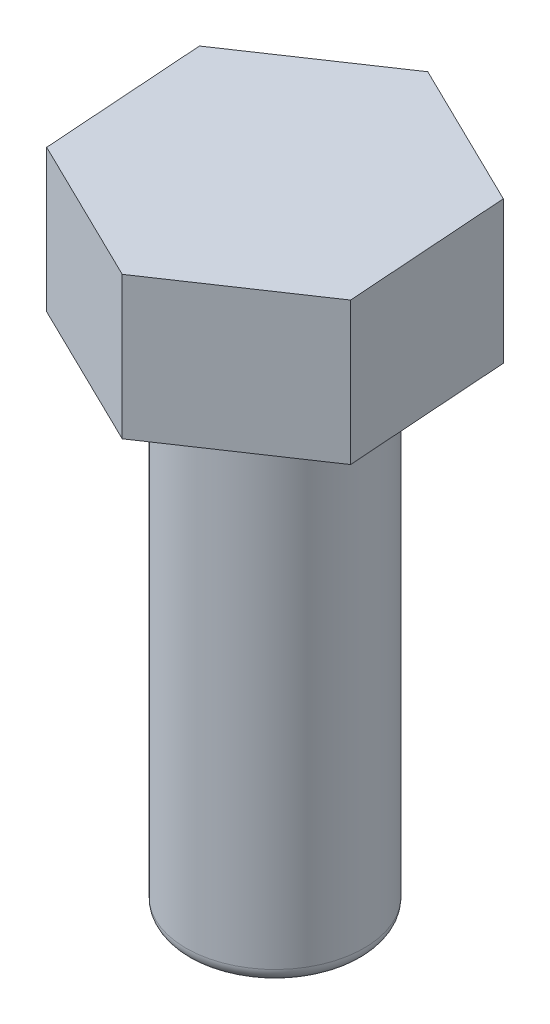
ISO-10303-21;
HEADER;
FILE_DESCRIPTION(('STEP AP214'),'2;1');
FILE_NAME('part.step','',(''),(''),'','','');
FILE_SCHEMA(('AUTOMOTIVE_DESIGN { 1 0 10303 214 1 1 1 1 }'));
ENDSEC;
DATA;
#1=APPLICATION_CONTEXT('core data for automotive mechanical design processes');
#2=APPLICATION_PROTOCOL_DEFINITION('international standard','automotive_design',2000,#1);
#3=PRODUCT_CONTEXT('',#1,'mechanical');
#4=PRODUCT('Part','Part','',(#3));
#5=PRODUCT_RELATED_PRODUCT_CATEGORY('part','',(#4));
#6=PRODUCT_DEFINITION_FORMATION('','',#4);
#7=PRODUCT_DEFINITION_CONTEXT('part definition',#1,'design');
#8=PRODUCT_DEFINITION('design','',#6,#7);
#9=PRODUCT_DEFINITION_SHAPE('','',#8);
#10=(LENGTH_UNIT() NAMED_UNIT(*) SI_UNIT(.MILLI.,.METRE.));
#11=(NAMED_UNIT(*) PLANE_ANGLE_UNIT() SI_UNIT($,.RADIAN.));
#12=(NAMED_UNIT(*) SI_UNIT($,.STERADIAN.) SOLID_ANGLE_UNIT());
#13=UNCERTAINTY_MEASURE_WITH_UNIT(LENGTH_MEASURE(1.E-05),#10,'distance_accuracy_value','');
#14=(GEOMETRIC_REPRESENTATION_CONTEXT(3) GLOBAL_UNCERTAINTY_ASSIGNED_CONTEXT((#13)) GLOBAL_UNIT_ASSIGNED_CONTEXT((#10,
#11,#12)) REPRESENTATION_CONTEXT('',''));
#15=CARTESIAN_POINT('',(0.,0.,0.));
#16=DIRECTION('',(0.,0.,1.));
#17=DIRECTION('',(1.,0.,0.));
#18=AXIS2_PLACEMENT_3D('',#15,#16,#17);
#19=CARTESIAN_POINT('',(15.9117753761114,-200.,230.391294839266));
#20=DIRECTION('',(0.558480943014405,0.,0.829517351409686));
#21=DIRECTION('',(0.829517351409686,0.,-0.558480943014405));
#22=AXIS2_PLACEMENT_3D('',#19,#20,#21);
#23=PLANE('',#22);
#24=DIRECTION('',(0.829517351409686,0.,-0.558480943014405));
#25=VECTOR('',#24,1.);
#26=CARTESIAN_POINT('',(15.9117753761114,0.,230.391294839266));
#27=LINE('',#26,#25);
#28=CARTESIAN_POINT('',(15.9117753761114,0.,230.391294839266));
#29=VERTEX_POINT('',#28);
#30=CARTESIAN_POINT('',(207.480601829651,0.,101.415645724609));
#31=VERTEX_POINT('',#30);
#32=EDGE_CURVE('E123',#29,#31,#27,.T.);
#33=ORIENTED_EDGE('',*,*,#32,.F.);
#34=DIRECTION('',(0.,1.,0.));
#35=VECTOR('',#34,1.);
#36=CARTESIAN_POINT('',(15.9117753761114,-200.,230.391294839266));
#37=LINE('',#36,#35);
#38=CARTESIAN_POINT('',(15.9117753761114,-200.,230.391294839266));
#39=VERTEX_POINT('',#38);
#40=EDGE_CURVE('E52',#39,#29,#37,.T.);
#41=ORIENTED_EDGE('',*,*,#40,.F.);
#42=DIRECTION('',(0.829517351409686,0.,-0.558480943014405));
#43=VECTOR('',#42,1.);
#44=CARTESIAN_POINT('',(15.9117753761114,-200.,230.391294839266));
#45=LINE('',#44,#43);
#46=CARTESIAN_POINT('',(207.480601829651,-200.,101.415645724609));
#47=VERTEX_POINT('',#46);
#48=EDGE_CURVE('E139',#39,#47,#45,.T.);
#49=ORIENTED_EDGE('',*,*,#48,.T.);
#50=DIRECTION('',(0.,1.,0.));
#51=VECTOR('',#50,1.);
#52=CARTESIAN_POINT('',(207.480601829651,-200.,101.415645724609));
#53=LINE('',#52,#51);
#54=EDGE_CURVE('E87',#47,#31,#53,.T.);
#55=ORIENTED_EDGE('',*,*,#54,.T.);
#56=EDGE_LOOP('',(#33,#41,#49,#55));
#57=FACE_BOUND('',#56,.T.);
#58=ADVANCED_FACE('F35',(#57),#23,.T.);
#59=CARTESIAN_POINT('',(-191.568826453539,-200.,128.975649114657));
#60=DIRECTION('',(-0.439142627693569,0.,0.898417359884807));
#61=DIRECTION('',(0.898417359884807,0.,0.439142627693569));
#62=AXIS2_PLACEMENT_3D('',#59,#60,#61);
#63=PLANE('',#62);
#64=DIRECTION('',(0.898417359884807,0.,0.439142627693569));
#65=VECTOR('',#64,1.);
#66=CARTESIAN_POINT('',(-191.568826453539,0.,128.975649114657));
#67=LINE('',#66,#65);
#68=CARTESIAN_POINT('',(-191.568826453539,0.,128.975649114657));
#69=VERTEX_POINT('',#68);
#70=EDGE_CURVE('E136',#69,#29,#67,.T.);
#71=ORIENTED_EDGE('',*,*,#70,.F.);
#72=DIRECTION('',(0.,1.,0.));
#73=VECTOR('',#72,1.);
#74=CARTESIAN_POINT('',(-191.568826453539,-200.,128.975649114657));
#75=LINE('',#74,#73);
#76=CARTESIAN_POINT('',(-191.568826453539,-200.,128.975649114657));
#77=VERTEX_POINT('',#76);
#78=EDGE_CURVE('E75',#77,#69,#75,.T.);
#79=ORIENTED_EDGE('',*,*,#78,.F.);
#80=DIRECTION('',(0.898417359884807,0.,0.439142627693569));
#81=VECTOR('',#80,1.);
#82=CARTESIAN_POINT('',(-191.568826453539,-200.,128.975649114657));
#83=LINE('',#82,#81);
#84=EDGE_CURVE('E113',#77,#39,#83,.T.);
#85=ORIENTED_EDGE('',*,*,#84,.T.);
#86=ORIENTED_EDGE('',*,*,#40,.T.);
#87=EDGE_LOOP('',(#71,#79,#85,#86));
#88=FACE_BOUND('',#87,.T.);
#89=ADVANCED_FACE('F161',(#88),#63,.T.);
#90=CARTESIAN_POINT('',(-207.480601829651,-200.,-101.415645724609));
#91=DIRECTION('',(-0.997623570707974,0.,0.068900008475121));
#92=DIRECTION('',(0.068900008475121,0.,0.997623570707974));
#93=AXIS2_PLACEMENT_3D('',#90,#91,#92);
#94=PLANE('',#93);
#95=DIRECTION('',(0.068900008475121,0.,0.997623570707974));
#96=VECTOR('',#95,1.);
#97=CARTESIAN_POINT('',(-207.480601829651,0.,-101.415645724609));
#98=LINE('',#97,#96);
#99=CARTESIAN_POINT('',(-207.480601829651,0.,-101.415645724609));
#100=VERTEX_POINT('',#99);
#101=EDGE_CURVE('E100',#100,#69,#98,.T.);
#102=ORIENTED_EDGE('',*,*,#101,.F.);
#103=DIRECTION('',(0.,1.,0.));
#104=VECTOR('',#103,1.);
#105=CARTESIAN_POINT('',(-207.480601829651,-200.,-101.415645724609));
#106=LINE('',#105,#104);
#107=CARTESIAN_POINT('',(-207.480601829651,-200.,-101.415645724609));
#108=VERTEX_POINT('',#107);
#109=EDGE_CURVE('E95',#108,#100,#106,.T.);
#110=ORIENTED_EDGE('',*,*,#109,.F.);
#111=DIRECTION('',(0.068900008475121,0.,0.997623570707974));
#112=VECTOR('',#111,1.);
#113=CARTESIAN_POINT('',(-207.480601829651,-200.,-101.415645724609));
#114=LINE('',#113,#112);
#115=EDGE_CURVE('E98',#108,#77,#114,.T.);
#116=ORIENTED_EDGE('',*,*,#115,.T.);
#117=ORIENTED_EDGE('',*,*,#78,.T.);
#118=EDGE_LOOP('',(#102,#110,#116,#117));
#119=FACE_BOUND('',#118,.T.);
#120=ADVANCED_FACE('F97',(#119),#94,.T.);
#121=CARTESIAN_POINT('',(-15.9117753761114,-200.,-230.391294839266));
#122=DIRECTION('',(-0.558480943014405,0.,-0.829517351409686));
#123=DIRECTION('',(-0.829517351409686,0.,0.558480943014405));
#124=AXIS2_PLACEMENT_3D('',#121,#122,#123);
#125=PLANE('',#124);
#126=DIRECTION('',(-0.829517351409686,0.,0.558480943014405));
#127=VECTOR('',#126,1.);
#128=CARTESIAN_POINT('',(-15.9117753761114,0.,-230.391294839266));
#129=LINE('',#128,#127);
#130=CARTESIAN_POINT('',(-15.9117753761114,0.,-230.391294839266));
#131=VERTEX_POINT('',#130);
#132=EDGE_CURVE('E133',#131,#100,#129,.T.);
#133=ORIENTED_EDGE('',*,*,#132,.F.);
#134=DIRECTION('',(0.,1.,0.));
#135=VECTOR('',#134,1.);
#136=CARTESIAN_POINT('',(-15.9117753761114,-200.,-230.391294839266));
#137=LINE('',#136,#135);
#138=CARTESIAN_POINT('',(-15.9117753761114,-200.,-230.391294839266));
#139=VERTEX_POINT('',#138);
#140=EDGE_CURVE('E105',#139,#131,#137,.T.);
#141=ORIENTED_EDGE('',*,*,#140,.F.);
#142=DIRECTION('',(-0.829517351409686,0.,0.558480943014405));
#143=VECTOR('',#142,1.);
#144=CARTESIAN_POINT('',(-15.9117753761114,-200.,-230.391294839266));
#145=LINE('',#144,#143);
#146=EDGE_CURVE('E111',#139,#108,#145,.T.);
#147=ORIENTED_EDGE('',*,*,#146,.T.);
#148=ORIENTED_EDGE('',*,*,#109,.T.);
#149=EDGE_LOOP('',(#133,#141,#147,#148));
#150=FACE_BOUND('',#149,.T.);
#151=ADVANCED_FACE('F115',(#150),#125,.T.);
#152=CARTESIAN_POINT('',(191.568826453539,-200.,-128.975649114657));
#153=DIRECTION('',(0.439142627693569,0.,-0.898417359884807));
#154=DIRECTION('',(-0.898417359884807,0.,-0.439142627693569));
#155=AXIS2_PLACEMENT_3D('',#152,#153,#154);
#156=PLANE('',#155);
#157=DIRECTION('',(-0.898417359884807,0.,-0.439142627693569));
#158=VECTOR('',#157,1.);
#159=CARTESIAN_POINT('',(191.568826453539,0.,-128.975649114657));
#160=LINE('',#159,#158);
#161=CARTESIAN_POINT('',(191.568826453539,0.,-128.975649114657));
#162=VERTEX_POINT('',#161);
#163=EDGE_CURVE('E130',#162,#131,#160,.T.);
#164=ORIENTED_EDGE('',*,*,#163,.F.);
#165=DIRECTION('',(0.,1.,0.));
#166=VECTOR('',#165,1.);
#167=CARTESIAN_POINT('',(191.568826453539,-200.,-128.975649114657));
#168=LINE('',#167,#166);
#169=CARTESIAN_POINT('',(191.568826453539,-200.,-128.975649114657));
#170=VERTEX_POINT('',#169);
#171=EDGE_CURVE('E143',#170,#162,#168,.T.);
#172=ORIENTED_EDGE('',*,*,#171,.F.);
#173=DIRECTION('',(-0.898417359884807,0.,-0.439142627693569));
#174=VECTOR('',#173,1.);
#175=CARTESIAN_POINT('',(191.568826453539,-200.,-128.975649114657));
#176=LINE('',#175,#174);
#177=EDGE_CURVE('E116',#170,#139,#176,.T.);
#178=ORIENTED_EDGE('',*,*,#177,.T.);
#179=ORIENTED_EDGE('',*,*,#140,.T.);
#180=EDGE_LOOP('',(#164,#172,#178,#179));
#181=FACE_BOUND('',#180,.T.);
#182=ADVANCED_FACE('F170',(#181),#156,.T.);
#183=CARTESIAN_POINT('',(207.480601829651,-200.,101.415645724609));
#184=DIRECTION('',(0.997623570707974,0.,-0.0689000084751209));
#185=DIRECTION('',(-0.068900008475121,0.,-0.997623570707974));
#186=AXIS2_PLACEMENT_3D('',#183,#184,#185);
#187=PLANE('',#186);
#188=DIRECTION('',(-0.068900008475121,0.,-0.997623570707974));
#189=VECTOR('',#188,1.);
#190=CARTESIAN_POINT('',(207.480601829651,0.,101.415645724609));
#191=LINE('',#190,#189);
#192=EDGE_CURVE('E126',#31,#162,#191,.T.);
#193=ORIENTED_EDGE('',*,*,#192,.F.);
#194=ORIENTED_EDGE('',*,*,#54,.F.);
#195=DIRECTION('',(-0.068900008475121,0.,-0.997623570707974));
#196=VECTOR('',#195,1.);
#197=CARTESIAN_POINT('',(207.480601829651,-200.,101.415645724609));
#198=LINE('',#197,#196);
#199=EDGE_CURVE('E118',#47,#170,#198,.T.);
#200=ORIENTED_EDGE('',*,*,#199,.T.);
#201=ORIENTED_EDGE('',*,*,#171,.T.);
#202=EDGE_LOOP('',(#193,#194,#200,#201));
#203=FACE_BOUND('',#202,.T.);
#204=ADVANCED_FACE('F167',(#203),#187,.T.);
#205=CARTESIAN_POINT('',(0.,-200.,0.));
#206=DIRECTION('',(0.,1.,0.));
#207=DIRECTION('',(0.,0.,1.));
#208=AXIS2_PLACEMENT_3D('',#205,#206,#207);
#209=PLANE('',#208);
#210=CARTESIAN_POINT('',(0.,-200.,0.));
#211=DIRECTION('',(0.,1.,0.));
#212=DIRECTION('',(0.,0.,1.));
#213=AXIS2_PLACEMENT_3D('',#210,#211,#212);
#214=CIRCLE('',#213,125.);
#215=CARTESIAN_POINT('',(0.,-200.,125.));
#216=VERTEX_POINT('',#215);
#217=EDGE_CURVE('E127',#216,#216,#214,.T.);
#218=ORIENTED_EDGE('',*,*,#217,.T.);
#219=EDGE_LOOP('',(#218));
#220=FACE_BOUND('',#219,.T.);
#221=ORIENTED_EDGE('',*,*,#48,.F.);
#222=ORIENTED_EDGE('',*,*,#84,.F.);
#223=ORIENTED_EDGE('',*,*,#115,.F.);
#224=ORIENTED_EDGE('',*,*,#146,.F.);
#225=ORIENTED_EDGE('',*,*,#177,.F.);
#226=ORIENTED_EDGE('',*,*,#199,.F.);
#227=EDGE_LOOP('',(#221,#222,#223,#224,#225,#226));
#228=FACE_BOUND('',#227,.T.);
#229=ADVANCED_FACE('F109',(#220,#228),#209,.F.);
#230=CARTESIAN_POINT('',(0.,0.,0.));
#231=DIRECTION('',(0.,1.,0.));
#232=DIRECTION('',(0.,0.,1.));
#233=AXIS2_PLACEMENT_3D('',#230,#231,#232);
#234=PLANE('',#233);
#235=ORIENTED_EDGE('',*,*,#32,.T.);
#236=ORIENTED_EDGE('',*,*,#192,.T.);
#237=ORIENTED_EDGE('',*,*,#163,.T.);
#238=ORIENTED_EDGE('',*,*,#132,.T.);
#239=ORIENTED_EDGE('',*,*,#101,.T.);
#240=ORIENTED_EDGE('',*,*,#70,.T.);
#241=EDGE_LOOP('',(#235,#236,#237,#238,#239,#240));
#242=FACE_BOUND('',#241,.T.);
#243=ADVANCED_FACE('F178',(#242),#234,.T.);
#244=CARTESIAN_POINT('',(0.,-900.,0.));
#245=DIRECTION('',(0.,1.,0.));
#246=DIRECTION('',(0.,0.,1.));
#247=AXIS2_PLACEMENT_3D('',#244,#245,#246);
#248=CYLINDRICAL_SURFACE('',#247,125.);
#249=CARTESIAN_POINT('',(0.,-880.,0.));
#250=DIRECTION('',(0.,1.,0.));
#251=DIRECTION('',(0.,0.,1.));
#252=AXIS2_PLACEMENT_3D('',#249,#250,#251);
#253=CIRCLE('',#252,125.);
#254=CARTESIAN_POINT('',(0.,-880.,125.));
#255=VERTEX_POINT('',#254);
#256=EDGE_CURVE('E44',#255,#255,#253,.T.);
#257=ORIENTED_EDGE('',*,*,#256,.T.);
#258=EDGE_LOOP('',(#257));
#259=FACE_BOUND('',#258,.T.);
#260=ORIENTED_EDGE('',*,*,#217,.F.);
#261=EDGE_LOOP('',(#260));
#262=FACE_BOUND('',#261,.T.);
#263=ADVANCED_FACE('F148',(#259,#262),#248,.T.);
#264=CARTESIAN_POINT('',(0.,-900.,0.));
#265=DIRECTION('',(0.,1.,0.));
#266=DIRECTION('',(0.,0.,1.));
#267=AXIS2_PLACEMENT_3D('',#264,#265,#266);
#268=PLANE('',#267);
#269=CARTESIAN_POINT('',(0.,-900.,0.));
#270=DIRECTION('',(0.,1.,0.));
#271=DIRECTION('',(0.,0.,1.));
#272=AXIS2_PLACEMENT_3D('',#269,#270,#271);
#273=CIRCLE('',#272,105.);
#274=CARTESIAN_POINT('',(0.,-900.,105.));
#275=VERTEX_POINT('',#274);
#276=EDGE_CURVE('E11',#275,#275,#273,.F.);
#277=ORIENTED_EDGE('',*,*,#276,.T.);
#278=EDGE_LOOP('',(#277));
#279=FACE_BOUND('',#278,.T.);
#280=ADVANCED_FACE('F152',(#279),#268,.F.);
#281=CARTESIAN_POINT('',(0.,-880.,0.));
#282=DIRECTION('',(0.,1.,0.));
#283=DIRECTION('',(0.,0.,1.));
#284=AXIS2_PLACEMENT_3D('',#281,#282,#283);
#285=TOROIDAL_SURFACE('',#284,105.,20.);
#286=ORIENTED_EDGE('',*,*,#276,.F.);
#287=EDGE_LOOP('',(#286));
#288=FACE_BOUND('',#287,.T.);
#289=ORIENTED_EDGE('',*,*,#256,.F.);
#290=EDGE_LOOP('',(#289));
#291=FACE_BOUND('',#290,.T.);
#292=ADVANCED_FACE('F37',(#288,#291),#285,.T.);
#293=CLOSED_SHELL('',(#58,#89,#120,#151,#182,#204,#229,#243,#263,#280,#292));
#294=MANIFOLD_SOLID_BREP('B2',#293);
#295=ADVANCED_BREP_SHAPE_REPRESENTATION('',(#18,#294),#14);
#296=SHAPE_DEFINITION_REPRESENTATION(#9,#295);
ENDSEC;
END-ISO-10303-21;
